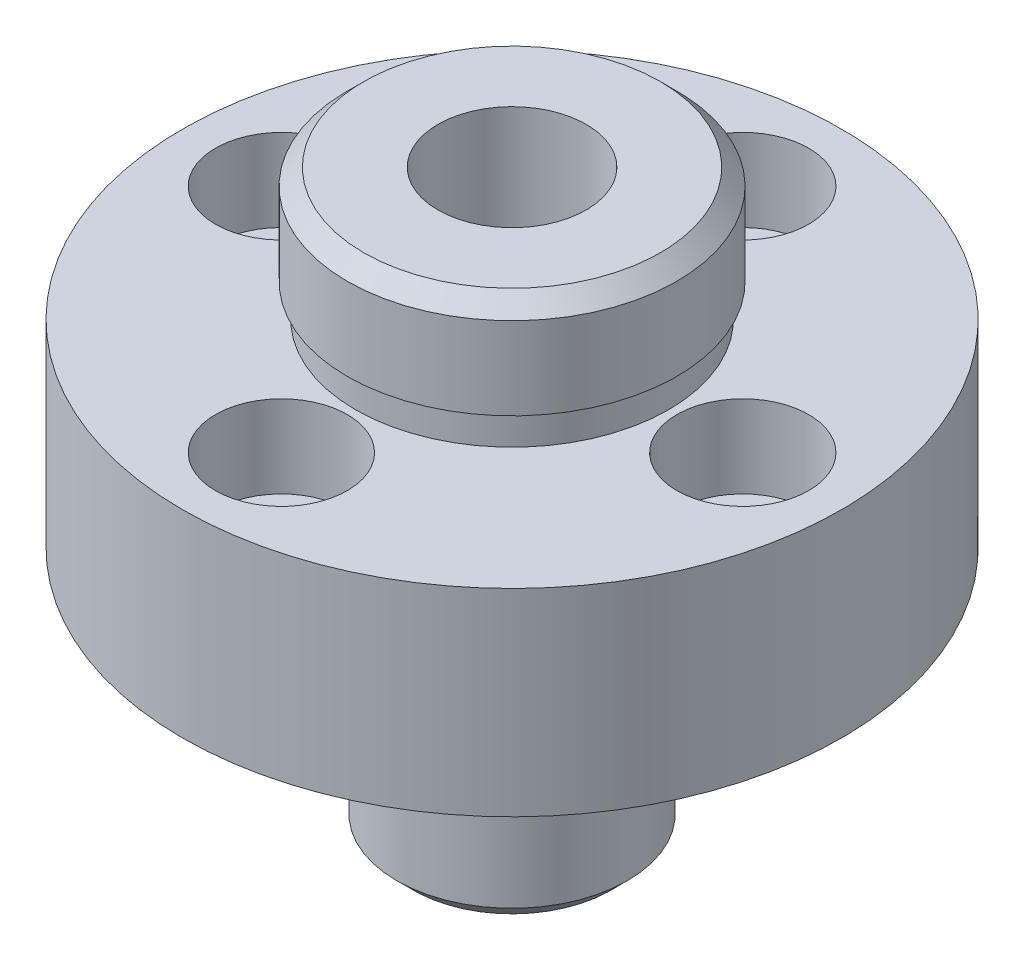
from build123d import *

# Parameters (mm, degrees)
CHANFREIN1_SIZE                                    = 1
CHAMBRAGE_POUR_VIS_T_TE_HEXAGONALE_M41_D           = 4.5
CHAMBRAGE_POUR_VIS_T_TE_HEXAGONALE_M41_CBORE_D     = 8
CHAMBRAGE_POUR_VIS_T_TE_HEXAGONALE_M41_CBORE_DEPTH = 5
TROU_TARAUD_M10X1_01_D                             = 9


with BuildPart() as part:
    # Esquisse1 → R_volution1 (revolve)
    with BuildSketch(Plane.XY, mode=Mode.PRIVATE) as r_volution1_sk:
        Polygon((0, 0), (-7, 0), (-7, 13), (-6.5, 13), (-6.5, 15), (-20, 15), (-20, 27), (-9.5, 27), (-9.5, 29), (-10, 29), (-10, 35), (0, 35), align=None)
    revolve(r_volution1_sk.sketch.rotate(Axis((0, 35, 0), (0, -1, 0)), 270), axis=Axis((0, 35, 0), (0, -1, 0)))

    # Chanfrein1
    chanfrein1_edges = [part.edges().sort_by_distance(p)[0] for p in [
        (0, 0, -7),
        (0, 35, -10),
    ]]
    chamfer(chanfrein1_edges, length=CHANFREIN1_SIZE)

    # Chambrage pour vis _ t_te hexagonale M41 (through all)
    with Locations(Plane(origin=(-14, 27, 0), x_dir=(0, 0, 1), z_dir=(0, 1, 0))):
        with Locations((0, 0), (-14, 14), (0, 28), (14, 14)):
            CounterBoreHole(CHAMBRAGE_POUR_VIS_T_TE_HEXAGONALE_M41_D / 2, CHAMBRAGE_POUR_VIS_T_TE_HEXAGONALE_M41_CBORE_D / 2, CHAMBRAGE_POUR_VIS_T_TE_HEXAGONALE_M41_CBORE_DEPTH)

    # Trou taraud_ M10x1.01 (through all)
    with Locations(Plane.ZX.offset(35)):
        with Locations((0, 0)):
            Hole(TROU_TARAUD_M10X1_01_D / 2)


solid = part.part
